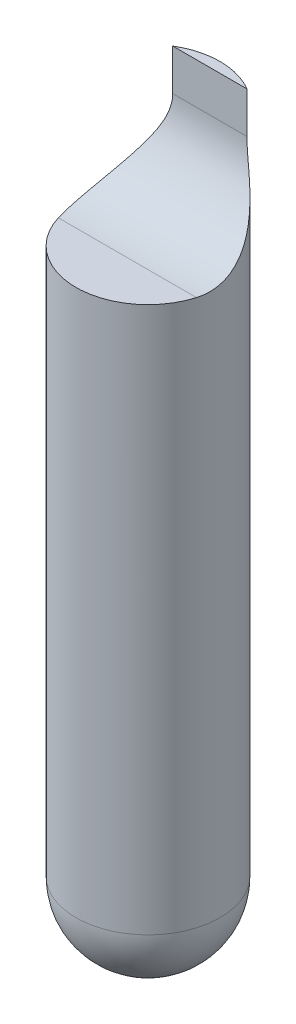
ISO-10303-21;
HEADER;
FILE_DESCRIPTION(('STEP AP214'),'2;1');
FILE_NAME('part.step','',(''),(''),'','','');
FILE_SCHEMA(('AUTOMOTIVE_DESIGN { 1 0 10303 214 1 1 1 1 }'));
ENDSEC;
DATA;
#1=APPLICATION_CONTEXT('core data for automotive mechanical design processes');
#2=APPLICATION_PROTOCOL_DEFINITION('international standard','automotive_design',2000,#1);
#3=PRODUCT_CONTEXT('',#1,'mechanical');
#4=PRODUCT('Part','Part','',(#3));
#5=PRODUCT_RELATED_PRODUCT_CATEGORY('part','',(#4));
#6=PRODUCT_DEFINITION_FORMATION('','',#4);
#7=PRODUCT_DEFINITION_CONTEXT('part definition',#1,'design');
#8=PRODUCT_DEFINITION('design','',#6,#7);
#9=PRODUCT_DEFINITION_SHAPE('','',#8);
#10=(LENGTH_UNIT() NAMED_UNIT(*) SI_UNIT(.MILLI.,.METRE.));
#11=(NAMED_UNIT(*) PLANE_ANGLE_UNIT() SI_UNIT($,.RADIAN.));
#12=(NAMED_UNIT(*) SI_UNIT($,.STERADIAN.) SOLID_ANGLE_UNIT());
#13=UNCERTAINTY_MEASURE_WITH_UNIT(LENGTH_MEASURE(1.E-05),#10,'distance_accuracy_value','');
#14=(GEOMETRIC_REPRESENTATION_CONTEXT(3) GLOBAL_UNCERTAINTY_ASSIGNED_CONTEXT((#13)) GLOBAL_UNIT_ASSIGNED_CONTEXT((#10,
#11,#12)) REPRESENTATION_CONTEXT('',''));
#15=CARTESIAN_POINT('',(0.,0.,0.));
#16=DIRECTION('',(0.,0.,1.));
#17=DIRECTION('',(1.,0.,0.));
#18=AXIS2_PLACEMENT_3D('',#15,#16,#17);
#19=CARTESIAN_POINT('',(0.,457.2,0.));
#20=DIRECTION('',(0.,-1.,0.));
#21=DIRECTION('',(0.,0.,-1.));
#22=AXIS2_PLACEMENT_3D('',#19,#20,#21);
#23=CYLINDRICAL_SURFACE('',#22,44.45);
#24=CARTESIAN_POINT('',(0.,44.45,0.));
#25=DIRECTION('',(0.,-1.,0.));
#26=DIRECTION('',(0.,0.,-1.));
#27=AXIS2_PLACEMENT_3D('',#24,#25,#26);
#28=CIRCLE('',#27,44.45);
#29=CARTESIAN_POINT('',(0.,44.45,-44.45));
#30=VERTEX_POINT('',#29);
#31=EDGE_CURVE('E81',#30,#30,#28,.F.);
#32=ORIENTED_EDGE('',*,*,#31,.T.);
#33=EDGE_LOOP('',(#32));
#34=FACE_BOUND('',#33,.T.);
#35=DIRECTION('',(0.,-1.,0.));
#36=VECTOR('',#35,1.);
#37=CARTESIAN_POINT('',(22.8952505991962,457.2,-38.1000000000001));
#38=LINE('',#37,#36);
#39=CARTESIAN_POINT('',(22.8952505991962,457.2,-38.1000000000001));
#40=VERTEX_POINT('',#39);
#41=CARTESIAN_POINT('',(22.8952505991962,431.8,-38.1000000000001));
#42=VERTEX_POINT('',#41);
#43=EDGE_CURVE('E48',#40,#42,#38,.T.);
#44=ORIENTED_EDGE('',*,*,#43,.T.);
#45=CARTESIAN_POINT('',(22.8952505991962,431.8,-38.1000000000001));
#46=CARTESIAN_POINT('',(22.8951933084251,431.363212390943,-38.1000150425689));
#47=CARTESIAN_POINT('',(22.904623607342,430.926445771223,-38.0943670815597));
#48=CARTESIAN_POINT('',(22.9420333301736,430.054079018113,-38.0718593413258));
#49=CARTESIAN_POINT('',(22.9700091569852,429.618478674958,-38.0550017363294));
#50=CARTESIAN_POINT('',(23.0439959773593,428.750433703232,-38.0102421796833));
#51=CARTESIAN_POINT('',(23.0899638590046,428.317984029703,-37.9823666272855));
#52=CARTESIAN_POINT('',(23.1991346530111,427.456125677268,-37.9157845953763));
#53=CARTESIAN_POINT('',(23.2623382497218,427.026717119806,-37.8770776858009));
#54=CARTESIAN_POINT('',(23.4741498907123,425.757547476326,-37.7464472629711));
#55=CARTESIAN_POINT('',(23.6461881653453,424.923136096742,-37.639289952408));
#56=CARTESIAN_POINT('',(24.0442952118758,423.273095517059,-37.3862243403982));
#57=CARTESIAN_POINT('',(24.2704014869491,422.457479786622,-37.2402891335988));
#58=CARTESIAN_POINT('',(24.8889123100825,420.45106093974,-36.8312494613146));
#59=CARTESIAN_POINT('',(25.3083976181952,419.273140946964,-36.5458261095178));
#60=CARTESIAN_POINT('',(26.2157745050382,416.965259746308,-35.900496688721));
#61=CARTESIAN_POINT('',(26.7037005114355,415.835323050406,-35.5405530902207));
#62=CARTESIAN_POINT('',(27.7286252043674,413.61114995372,-34.7469419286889));
#63=CARTESIAN_POINT('',(28.2660311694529,412.517333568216,-34.3126314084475));
#64=CARTESIAN_POINT('',(29.3670821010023,410.373613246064,-33.3751389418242));
#65=CARTESIAN_POINT('',(29.9307243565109,409.323704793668,-32.8719641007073));
#66=CARTESIAN_POINT('',(30.8794120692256,407.609267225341,-31.9771300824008));
#67=CARTESIAN_POINT('',(31.261286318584,406.933056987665,-31.6042942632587));
#68=CARTESIAN_POINT('',(32.0265277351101,405.598871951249,-30.8285704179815));
#69=CARTESIAN_POINT('',(32.4098949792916,404.940898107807,-30.4256808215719));
#70=CARTESIAN_POINT('',(33.174890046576,403.642989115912,-29.5897003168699));
#71=CARTESIAN_POINT('',(33.5565172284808,403.003060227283,-29.1565991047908));
#72=CARTESIAN_POINT('',(34.3148389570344,401.741714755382,-28.2602016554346));
#73=CARTESIAN_POINT('',(34.6915336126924,401.120297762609,-27.7969060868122));
#74=CARTESIAN_POINT('',(35.4357872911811,399.898603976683,-26.8416230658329));
#75=CARTESIAN_POINT('',(35.8033741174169,399.298259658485,-26.3497438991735));
#76=CARTESIAN_POINT('',(36.5279845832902,398.117186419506,-25.3356945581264));
#77=CARTESIAN_POINT('',(36.8850079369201,397.536458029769,-24.8135235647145));
#78=CARTESIAN_POINT('',(37.9358217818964,395.825552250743,-23.2017132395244));
#79=CARTESIAN_POINT('',(38.6099339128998,394.725716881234,-22.0660463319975));
#80=CARTESIAN_POINT('',(39.6908947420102,392.935974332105,-20.0333098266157));
#81=CARTESIAN_POINT('',(40.117134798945,392.222288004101,-19.1672497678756));
#82=CARTESIAN_POINT('',(40.9247006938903,390.84475686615,-17.3762982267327));
#83=CARTESIAN_POINT('',(41.3060300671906,390.180908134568,-16.4514113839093));
#84=CARTESIAN_POINT('',(42.015002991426,388.909117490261,-14.5456118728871));
#85=CARTESIAN_POINT('',(42.3426964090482,388.301123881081,-13.5647524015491));
#86=CARTESIAN_POINT('',(42.9361372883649,387.146391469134,-11.5495965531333));
#87=CARTESIAN_POINT('',(43.2018945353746,386.599642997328,-10.5153086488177));
#88=CARTESIAN_POINT('',(43.6267192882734,385.653980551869,-8.56427396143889));
#89=CARTESIAN_POINT('',(43.7959743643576,385.245321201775,-7.65446068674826));
#90=CARTESIAN_POINT('',(44.0792536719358,384.479706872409,-5.80489656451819));
#91=CARTESIAN_POINT('',(44.1932817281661,384.122748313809,-4.86514779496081));
#92=CARTESIAN_POINT('',(44.3614763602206,383.46415780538,-2.96203692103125));
#93=CARTESIAN_POINT('',(44.4156929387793,383.162479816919,-1.99869523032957));
#94=CARTESIAN_POINT('',(44.4605979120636,382.616810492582,-0.0543329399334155));
#95=CARTESIAN_POINT('',(44.4512920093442,382.372813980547,0.926686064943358));
#96=CARTESIAN_POINT('',(44.3701949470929,381.963596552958,2.80979629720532));
#97=CARTESIAN_POINT('',(44.3041129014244,381.793256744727,3.71102943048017));
#98=CARTESIAN_POINT('',(44.1157729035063,381.502269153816,5.5157681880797));
#99=CARTESIAN_POINT('',(43.9935167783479,381.381619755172,6.41927373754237));
#100=CARTESIAN_POINT('',(43.7675027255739,381.237446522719,7.77296714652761));
#101=CARTESIAN_POINT('',(43.6848411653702,381.195473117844,8.22488411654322));
#102=CARTESIAN_POINT('',(43.5053273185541,381.123796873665,9.12690310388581));
#103=CARTESIAN_POINT('',(43.4084749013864,381.094094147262,9.57700510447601));
#104=CARTESIAN_POINT('',(43.2006588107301,381.04677633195,10.4746271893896));
#105=CARTESIAN_POINT('',(43.0896934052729,381.029162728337,10.9221469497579));
#106=CARTESIAN_POINT('',(42.8538160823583,381.005770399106,11.8137976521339));
#107=CARTESIAN_POINT('',(42.7289044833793,380.999991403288,12.2579286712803));
#108=CARTESIAN_POINT('',(42.597094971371,381.,12.6999999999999));
#109=B_SPLINE_CURVE_WITH_KNOTS('',3,(#45,#46,#47,#48,#49,#50,#51,#52,#53,#54,#55,#56,#57,#58,
#59,#60,#61,#62,#63,#64,#65,#66,#67,#68,#69,#70,#71,#72,#73,#74,#75,#76,#77,#78,#79,#80,#81,#82,
#83,#84,#85,#86,#87,#88,#89,#90,#91,#92,#93,#94,#95,#96,#97,#98,#99,#100,#101,#102,#103,#104,
#105,#106,#107,#108),.UNSPECIFIED.,.F.,.F.,(4,2,2,2,2,2,2,2,2,2,2,2,2,2,2,2,2,2,2,2,2,2,2,2,2,2,
2,2,2,2,2,4),(0.,1.31018970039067,2.62012534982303,3.92694120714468,5.23380895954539,
7.80636024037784,10.3807011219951,14.221883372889,18.0650048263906,21.9432060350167,
25.8210074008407,28.404704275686,30.988536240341,33.5732537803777,36.1579141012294,
38.7333511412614,41.308857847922,46.4559207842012,50.0544723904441,53.6527405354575,
57.247644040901,60.8419792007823,63.8738592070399,66.9055292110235,69.9346627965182,
72.9635244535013,75.7193135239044,78.4750129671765,79.8586820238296,81.2423638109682,
82.6262155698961,84.0100357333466),.UNSPECIFIED.);
#110=CARTESIAN_POINT('',(42.597094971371,381.,12.6999999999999));
#111=VERTEX_POINT('',#110);
#112=EDGE_CURVE('E41',#42,#111,#109,.T.);
#113=ORIENTED_EDGE('',*,*,#112,.T.);
#114=CARTESIAN_POINT('',(0.,381.,0.));
#115=DIRECTION('',(0.,-1.,0.));
#116=DIRECTION('',(0.,0.,-1.));
#117=AXIS2_PLACEMENT_3D('',#114,#115,#116);
#118=CIRCLE('',#117,44.45);
#119=CARTESIAN_POINT('',(-42.597094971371,381.,12.6999999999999));
#120=VERTEX_POINT('',#119);
#121=EDGE_CURVE('E11',#111,#120,#118,.T.);
#122=ORIENTED_EDGE('',*,*,#121,.T.);
#123=CARTESIAN_POINT('',(-42.597094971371,381.,12.6999999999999));
#124=CARTESIAN_POINT('',(-42.7393001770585,380.999988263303,12.2230718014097));
#125=CARTESIAN_POINT('',(-42.8734736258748,381.006716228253,11.7437445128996));
#126=CARTESIAN_POINT('',(-43.1255746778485,381.033970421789,10.7812125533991));
#127=CARTESIAN_POINT('',(-43.2435018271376,381.05449703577,10.2980077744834));
#128=CARTESIAN_POINT('',(-43.4629067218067,381.10966408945,9.32872696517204));
#129=CARTESIAN_POINT('',(-43.5643864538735,381.144302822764,8.84265128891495));
#130=CARTESIAN_POINT('',(-43.750811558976,381.227905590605,7.86860826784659));
#131=CARTESIAN_POINT('',(-43.835757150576,381.276869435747,7.38064094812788));
#132=CARTESIAN_POINT('',(-44.0648820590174,381.444898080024,5.92070111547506));
#133=CARTESIAN_POINT('',(-44.1845994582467,381.585410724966,4.94714839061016));
#134=CARTESIAN_POINT('',(-44.3590723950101,381.924061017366,3.00446620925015));
#135=CARTESIAN_POINT('',(-44.4138305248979,382.122196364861,2.03533657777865));
#136=CARTESIAN_POINT('',(-44.4603091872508,382.57520267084,0.108792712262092));
#137=CARTESIAN_POINT('',(-44.452022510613,382.830080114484,-0.848620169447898));
#138=CARTESIAN_POINT('',(-44.3753298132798,383.394608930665,-2.74463450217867));
#139=CARTESIAN_POINT('',(-44.3069227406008,383.704261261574,-3.68323562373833));
#140=CARTESIAN_POINT('',(-44.1137050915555,384.375911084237,-5.53644845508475));
#141=CARTESIAN_POINT('',(-43.9888445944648,384.737954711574,-6.45103817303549));
#142=CARTESIAN_POINT('',(-43.6871272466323,385.510933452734,-8.25045705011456));
#143=CARTESIAN_POINT('',(-43.5102648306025,385.92187379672,-9.13528301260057));
#144=CARTESIAN_POINT('',(-43.055474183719,386.905563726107,-11.1042768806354));
#145=CARTESIAN_POINT('',(-42.76316158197,387.492146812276,-12.1782415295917));
#146=CARTESIAN_POINT('',(-42.1125490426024,388.731174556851,-14.2664885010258));
#147=CARTESIAN_POINT('',(-41.7542333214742,389.383634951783,-15.280756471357));
#148=CARTESIAN_POINT('',(-40.9810751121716,390.748451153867,-17.247365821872));
#149=CARTESIAN_POINT('',(-40.5661610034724,391.460882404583,-18.1996264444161));
#150=CARTESIAN_POINT('',(-39.6897933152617,392.938824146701,-20.0389901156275));
#151=CARTESIAN_POINT('',(-39.2283381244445,393.704336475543,-20.9260909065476));
#152=CARTESIAN_POINT('',(-38.1133369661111,395.537685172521,-22.9096736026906));
#153=CARTESIAN_POINT('',(-37.4457467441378,396.623564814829,-23.9817240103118));
#154=CARTESIAN_POINT('',(-36.410616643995,398.308526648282,-25.5038563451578));
#155=CARTESIAN_POINT('',(-36.0598351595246,398.879723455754,-25.9970494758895));
#156=CARTESIAN_POINT('',(-35.3494369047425,400.040241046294,-26.9550596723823));
#157=CARTESIAN_POINT('',(-34.9898200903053,400.629561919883,-27.4198765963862));
#158=CARTESIAN_POINT('',(-34.2633653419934,401.827296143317,-28.3224440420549));
#159=CARTESIAN_POINT('',(-33.8965105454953,402.43575670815,-28.760118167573));
#160=CARTESIAN_POINT('',(-33.1592163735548,403.669872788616,-29.6071627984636));
#161=CARTESIAN_POINT('',(-32.7887772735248,404.295526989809,-30.0165354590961));
#162=CARTESIAN_POINT('',(-32.0472247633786,405.563786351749,-30.8070030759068));
#163=CARTESIAN_POINT('',(-31.6761115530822,406.206387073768,-31.1881053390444));
#164=CARTESIAN_POINT('',(-30.9362641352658,407.508743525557,-31.9221189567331));
#165=CARTESIAN_POINT('',(-30.567529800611,408.168498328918,-32.2750318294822));
#166=CARTESIAN_POINT('',(-29.6679425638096,409.812346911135,-33.1080686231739));
#167=CARTESIAN_POINT('',(-29.1403307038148,410.806365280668,-33.5722659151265));
#168=CARTESIAN_POINT('',(-28.1101465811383,412.833501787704,-34.439445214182));
#169=CARTESIAN_POINT('',(-27.6075752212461,413.866621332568,-34.8424250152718));
#170=CARTESIAN_POINT('',(-26.6475105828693,415.965864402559,-35.5819719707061));
#171=CARTESIAN_POINT('',(-26.1896877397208,417.03165629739,-35.919046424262));
#172=CARTESIAN_POINT('',(-25.3348029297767,419.205934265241,-36.5270498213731));
#173=CARTESIAN_POINT('',(-24.9377219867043,420.314406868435,-36.7979994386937));
#174=CARTESIAN_POINT('',(-24.3260799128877,422.26429022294,-37.2040345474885));
#175=CARTESIAN_POINT('',(-24.0913014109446,423.09583348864,-37.3560115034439));
#176=CARTESIAN_POINT('',(-23.6775373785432,424.778742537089,-37.6196381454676));
#177=CARTESIAN_POINT('',(-23.4985118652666,425.630093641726,-37.7313167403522));
#178=CARTESIAN_POINT('',(-23.2779480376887,426.925440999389,-37.8674942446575));
#179=CARTESIAN_POINT('',(-23.2121026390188,427.363763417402,-37.9078516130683));
#180=CARTESIAN_POINT('',(-23.098332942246,428.243637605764,-37.9772823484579));
#181=CARTESIAN_POINT('',(-23.0504078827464,428.685189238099,-38.0063561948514));
#182=CARTESIAN_POINT('',(-22.9732497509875,429.57165267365,-38.0530478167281));
#183=CARTESIAN_POINT('',(-22.944064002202,430.016570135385,-38.0706365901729));
#184=CARTESIAN_POINT('',(-22.9050312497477,430.907650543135,-38.0941220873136));
#185=CARTESIAN_POINT('',(-22.895188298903,431.353813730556,-38.1000163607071));
#186=CARTESIAN_POINT('',(-22.8952505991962,431.8,-38.1000000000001));
#187=B_SPLINE_CURVE_WITH_KNOTS('',3,(#123,#124,#125,#126,#127,#128,#129,#130,#131,#132,#133,
#134,#135,#136,#137,#138,#139,#140,#141,#142,#143,#144,#145,#146,#147,#148,#149,#150,#151,#152,
#153,#154,#155,#156,#157,#158,#159,#160,#161,#162,#163,#164,#165,#166,#167,#168,#169,#170,#171,
#172,#173,#174,#175,#176,#177,#178,#179,#180,#181,#182,#183,#184,#185,#186),.UNSPECIFIED.,.F.,
.F.,(4,2,2,2,2,2,2,2,2,2,2,2,2,2,2,2,2,2,2,2,2,2,2,2,2,2,2,2,2,2,2,4),(0.,1.49292006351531,
2.98588182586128,4.47866311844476,5.97142467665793,8.93993726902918,11.9083313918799,
14.8770649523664,17.8458504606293,20.817266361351,23.7890003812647,27.5579708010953,
31.3278436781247,35.102532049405,38.8773511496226,43.8663472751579,46.3623935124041,
48.8584522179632,51.3612442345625,53.8638454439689,56.3657975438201,58.8676148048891,
62.5173141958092,66.1671450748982,69.787668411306,73.4070583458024,76.0366234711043,
78.6642984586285,79.9990903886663,81.3338255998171,82.6719183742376,84.0102914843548),.UNSPECIFIED.);
#188=CARTESIAN_POINT('',(-22.8952505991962,431.8,-38.1000000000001));
#189=VERTEX_POINT('',#188);
#190=EDGE_CURVE('E56',#120,#189,#187,.T.);
#191=ORIENTED_EDGE('',*,*,#190,.T.);
#192=DIRECTION('',(0.,-1.,0.));
#193=VECTOR('',#192,1.);
#194=CARTESIAN_POINT('',(-22.8952505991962,457.2,-38.1000000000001));
#195=LINE('',#194,#193);
#196=CARTESIAN_POINT('',(-22.8952505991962,457.2,-38.1000000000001));
#197=VERTEX_POINT('',#196);
#198=EDGE_CURVE('E75',#189,#197,#195,.F.);
#199=ORIENTED_EDGE('',*,*,#198,.T.);
#200=CARTESIAN_POINT('',(0.,457.2,0.));
#201=DIRECTION('',(0.,1.,0.));
#202=DIRECTION('',(0.,0.,1.));
#203=AXIS2_PLACEMENT_3D('',#200,#201,#202);
#204=CIRCLE('',#203,44.45);
#205=EDGE_CURVE('E79',#40,#197,#204,.T.);
#206=ORIENTED_EDGE('',*,*,#205,.F.);
#207=EDGE_LOOP('',(#44,#113,#122,#191,#199,#206));
#208=FACE_BOUND('',#207,.T.);
#209=ADVANCED_FACE('F33',(#34,#208),#23,.T.);
#210=CARTESIAN_POINT('',(0.,457.2,0.));
#211=DIRECTION('',(0.,1.,0.));
#212=DIRECTION('',(0.,0.,1.));
#213=AXIS2_PLACEMENT_3D('',#210,#211,#212);
#214=PLANE('',#213);
#215=DIRECTION('',(-1.,0.,0.));
#216=VECTOR('',#215,1.);
#217=CARTESIAN_POINT('',(0.,457.2,-38.1000000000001));
#218=LINE('',#217,#216);
#219=EDGE_CURVE('E88',#40,#197,#218,.T.);
#220=ORIENTED_EDGE('',*,*,#219,.F.);
#221=ORIENTED_EDGE('',*,*,#205,.T.);
#222=EDGE_LOOP('',(#220,#221));
#223=FACE_BOUND('',#222,.T.);
#224=ADVANCED_FACE('F104',(#223),#214,.T.);
#225=CARTESIAN_POINT('',(0.,44.45,0.));
#226=DIRECTION('',(0.,0.,1.));
#227=DIRECTION('',(1.,0.,0.));
#228=AXIS2_PLACEMENT_3D('',#225,#226,#227);
#229=SPHERICAL_SURFACE('',#228,44.45);
#230=CARTESIAN_POINT('',(0.,44.45,0.));
#231=DIRECTION('',(0.,-1.,0.));
#232=DIRECTION('',(0.,0.,-1.));
#233=AXIS2_PLACEMENT_3D('',#230,#231,#232);
#234=SPHERICAL_SURFACE('',#233,44.45);
#235=ORIENTED_EDGE('',*,*,#31,.F.);
#236=EDGE_LOOP('',(#235));
#237=FACE_BOUND('',#236,.T.);
#238=ADVANCED_FACE('F35',(#237),#234,.T.);
#239=CARTESIAN_POINT('',(44.45,431.8,12.6999999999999));
#240=DIRECTION('',(-1.,0.,0.));
#241=DIRECTION('',(0.,0.,1.));
#242=AXIS2_PLACEMENT_3D('',#239,#240,#241);
#243=CYLINDRICAL_SURFACE('',#242,50.8);
#244=DIRECTION('',(-1.,0.,0.));
#245=VECTOR('',#244,1.);
#246=CARTESIAN_POINT('',(44.45,381.,12.6999999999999));
#247=LINE('',#246,#245);
#248=EDGE_CURVE('E71',#111,#120,#247,.T.);
#249=ORIENTED_EDGE('',*,*,#248,.F.);
#250=ORIENTED_EDGE('',*,*,#112,.F.);
#251=DIRECTION('',(-1.,0.,0.));
#252=VECTOR('',#251,1.);
#253=CARTESIAN_POINT('',(44.45,431.8,-38.1000000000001));
#254=LINE('',#253,#252);
#255=EDGE_CURVE('E70',#42,#189,#254,.T.);
#256=ORIENTED_EDGE('',*,*,#255,.T.);
#257=ORIENTED_EDGE('',*,*,#190,.F.);
#258=EDGE_LOOP('',(#249,#250,#256,#257));
#259=FACE_BOUND('',#258,.T.);
#260=ADVANCED_FACE('F69',(#259),#243,.F.);
#261=CARTESIAN_POINT('',(44.45,381.,12.6999999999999));
#262=DIRECTION('',(0.,-1.,0.));
#263=DIRECTION('',(0.,0.,-1.));
#264=AXIS2_PLACEMENT_3D('',#261,#262,#263);
#265=PLANE('',#264);
#266=ORIENTED_EDGE('',*,*,#248,.T.);
#267=ORIENTED_EDGE('',*,*,#121,.F.);
#268=EDGE_LOOP('',(#266,#267));
#269=FACE_BOUND('',#268,.T.);
#270=ADVANCED_FACE('F102',(#269),#265,.F.);
#271=CARTESIAN_POINT('',(44.45,431.8,-38.1000000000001));
#272=DIRECTION('',(0.,0.,-1.));
#273=DIRECTION('',(-1.,0.,0.));
#274=AXIS2_PLACEMENT_3D('',#271,#272,#273);
#275=PLANE('',#274);
#276=ORIENTED_EDGE('',*,*,#219,.T.);
#277=ORIENTED_EDGE('',*,*,#198,.F.);
#278=ORIENTED_EDGE('',*,*,#255,.F.);
#279=ORIENTED_EDGE('',*,*,#43,.F.);
#280=EDGE_LOOP('',(#276,#277,#278,#279));
#281=FACE_BOUND('',#280,.T.);
#282=ADVANCED_FACE('F73',(#281),#275,.F.);
#283=CLOSED_SHELL('',(#209,#224,#238,#260,#270,#282));
#284=MANIFOLD_SOLID_BREP('B2',#283);
#285=ADVANCED_BREP_SHAPE_REPRESENTATION('',(#18,#284),#14);
#286=SHAPE_DEFINITION_REPRESENTATION(#9,#285);
ENDSEC;
END-ISO-10303-21;
